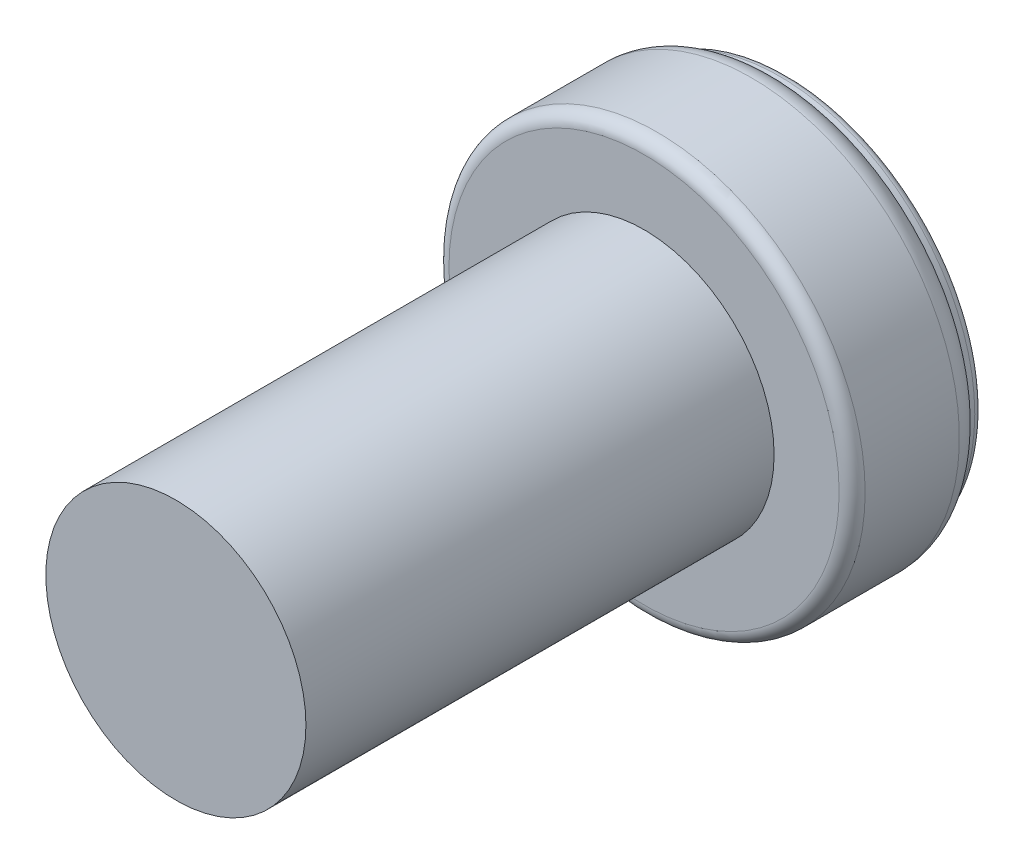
ISO-10303-21;
HEADER;
FILE_DESCRIPTION(('STEP AP214'),'2;1');
FILE_NAME('part.step','',(''),(''),'','','');
FILE_SCHEMA(('AUTOMOTIVE_DESIGN { 1 0 10303 214 1 1 1 1 }'));
ENDSEC;
DATA;
#1=APPLICATION_CONTEXT('core data for automotive mechanical design processes');
#2=APPLICATION_PROTOCOL_DEFINITION('international standard','automotive_design',2000,#1);
#3=PRODUCT_CONTEXT('',#1,'mechanical');
#4=PRODUCT('Part','Part','',(#3));
#5=PRODUCT_RELATED_PRODUCT_CATEGORY('part','',(#4));
#6=PRODUCT_DEFINITION_FORMATION('','',#4);
#7=PRODUCT_DEFINITION_CONTEXT('part definition',#1,'design');
#8=PRODUCT_DEFINITION('design','',#6,#7);
#9=PRODUCT_DEFINITION_SHAPE('','',#8);
#10=(LENGTH_UNIT() NAMED_UNIT(*) SI_UNIT(.MILLI.,.METRE.));
#11=(NAMED_UNIT(*) PLANE_ANGLE_UNIT() SI_UNIT($,.RADIAN.));
#12=(NAMED_UNIT(*) SI_UNIT($,.STERADIAN.) SOLID_ANGLE_UNIT());
#13=UNCERTAINTY_MEASURE_WITH_UNIT(LENGTH_MEASURE(1.E-05),#10,'distance_accuracy_value','');
#14=(GEOMETRIC_REPRESENTATION_CONTEXT(3) GLOBAL_UNCERTAINTY_ASSIGNED_CONTEXT((#13)) GLOBAL_UNIT_ASSIGNED_CONTEXT((#10,
#11,#12)) REPRESENTATION_CONTEXT('',''));
#15=CARTESIAN_POINT('',(0.,0.,0.));
#16=DIRECTION('',(0.,0.,1.));
#17=DIRECTION('',(1.,0.,0.));
#18=AXIS2_PLACEMENT_3D('',#15,#16,#17);
#19=CARTESIAN_POINT('',(0.0801792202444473,-0.24053766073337,4.98972152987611));
#20=DIRECTION('',(0.,0.,1.));
#21=DIRECTION('',(1.,0.,0.));
#22=AXIS2_PLACEMENT_3D('',#19,#20,#21);
#23=PLANE('',#22);
#24=CARTESIAN_POINT('',(0.0801792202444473,-0.24053766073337,4.98972152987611));
#25=DIRECTION('',(0.,0.,1.));
#26=DIRECTION('',(1.,0.,0.));
#27=AXIS2_PLACEMENT_3D('',#24,#25,#26);
#28=CIRCLE('',#27,7.5);
#29=CARTESIAN_POINT('',(7.58017922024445,-0.24053766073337,4.98972152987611));
#30=VERTEX_POINT('',#29);
#31=EDGE_CURVE('E40',#30,#30,#28,.T.);
#32=ORIENTED_EDGE('',*,*,#31,.T.);
#33=EDGE_LOOP('',(#32));
#34=FACE_BOUND('',#33,.T.);
#35=CARTESIAN_POINT('',(0.0801792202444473,-0.24053766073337,4.98972152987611));
#36=DIRECTION('',(0.,0.,1.));
#37=DIRECTION('',(1.,0.,0.));
#38=AXIS2_PLACEMENT_3D('',#35,#36,#37);
#39=CIRCLE('',#38,5.);
#40=CARTESIAN_POINT('',(5.08017922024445,-0.24053766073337,4.98972152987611));
#41=VERTEX_POINT('',#40);
#42=EDGE_CURVE('E102',#41,#41,#39,.T.);
#43=ORIENTED_EDGE('',*,*,#42,.F.);
#44=EDGE_LOOP('',(#43));
#45=FACE_BOUND('',#44,.T.);
#46=ADVANCED_FACE('F33',(#34,#45),#23,.T.);
#47=CARTESIAN_POINT('',(0.0801792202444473,-0.135203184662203,0.235788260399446));
#48=DIRECTION('',(0.,0.,-1.));
#49=DIRECTION('',(-1.,0.,0.));
#50=AXIS2_PLACEMENT_3D('',#47,#48,#49);
#51=PLANE('',#50);
#52=CARTESIAN_POINT('',(0.0801792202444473,-0.135203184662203,0.235788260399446));
#53=DIRECTION('',(0.,0.,-1.));
#54=DIRECTION('',(-1.,0.,0.));
#55=AXIS2_PLACEMENT_3D('',#52,#53,#54);
#56=CIRCLE('',#55,4.5);
#57=CARTESIAN_POINT('',(-4.41982077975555,-0.135203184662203,0.235788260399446));
#58=VERTEX_POINT('',#57);
#59=EDGE_CURVE('E92',#58,#58,#56,.T.);
#60=ORIENTED_EDGE('',*,*,#59,.T.);
#61=EDGE_LOOP('',(#60));
#62=FACE_BOUND('',#61,.T.);
#63=CARTESIAN_POINT('',(0.0801792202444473,-0.24053766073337,0.235788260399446));
#64=DIRECTION('',(0.,0.,-1.));
#65=DIRECTION('',(-1.,0.,0.));
#66=AXIS2_PLACEMENT_3D('',#63,#64,#65);
#67=CIRCLE('',#66,3.5);
#68=CARTESIAN_POINT('',(-3.41982077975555,-0.24053766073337,0.235788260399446));
#69=VERTEX_POINT('',#68);
#70=EDGE_CURVE('E95',#69,#69,#67,.T.);
#71=ORIENTED_EDGE('',*,*,#70,.F.);
#72=EDGE_LOOP('',(#71));
#73=FACE_BOUND('',#72,.T.);
#74=ADVANCED_FACE('F118',(#62,#73),#51,.T.);
#75=CARTESIAN_POINT('',(0.0801792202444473,-0.24053766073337,0.474548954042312));
#76=DIRECTION('',(0.,0.,-1.));
#77=DIRECTION('',(-1.,0.,0.));
#78=AXIS2_PLACEMENT_3D('',#75,#76,#77);
#79=PLANE('',#78);
#80=CARTESIAN_POINT('',(0.0801792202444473,-0.24053766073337,0.474548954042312));
#81=DIRECTION('',(0.,0.,-1.));
#82=DIRECTION('',(-1.,0.,0.));
#83=AXIS2_PLACEMENT_3D('',#80,#81,#82);
#84=CIRCLE('',#83,6.5);
#85=CARTESIAN_POINT('',(-6.41982077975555,-0.24053766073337,0.474548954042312));
#86=VERTEX_POINT('',#85);
#87=EDGE_CURVE('E86',#86,#86,#84,.T.);
#88=ORIENTED_EDGE('',*,*,#87,.T.);
#89=EDGE_LOOP('',(#88));
#90=FACE_BOUND('',#89,.T.);
#91=CARTESIAN_POINT('',(0.0801792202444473,-0.24053766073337,0.474548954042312));
#92=DIRECTION('',(0.,0.,-1.));
#93=DIRECTION('',(-1.,0.,0.));
#94=AXIS2_PLACEMENT_3D('',#91,#92,#93);
#95=CIRCLE('',#94,5.5);
#96=CARTESIAN_POINT('',(-5.41982077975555,-0.24053766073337,0.474548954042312));
#97=VERTEX_POINT('',#96);
#98=EDGE_CURVE('E89',#97,#97,#95,.T.);
#99=ORIENTED_EDGE('',*,*,#98,.F.);
#100=EDGE_LOOP('',(#99));
#101=FACE_BOUND('',#100,.T.);
#102=ADVANCED_FACE('F123',(#90,#101),#79,.T.);
#103=CARTESIAN_POINT('',(0.0801792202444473,-0.24053766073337,4.98972152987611));
#104=DIRECTION('',(0.,0.,-1.));
#105=DIRECTION('',(-1.,0.,0.));
#106=AXIS2_PLACEMENT_3D('',#103,#104,#105);
#107=CYLINDRICAL_SURFACE('',#106,8.);
#108=CARTESIAN_POINT('',(0.0801792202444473,-0.24053766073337,4.48972152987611));
#109=DIRECTION('',(0.,0.,1.));
#110=DIRECTION('',(1.,0.,0.));
#111=AXIS2_PLACEMENT_3D('',#108,#109,#110);
#112=CIRCLE('',#111,8.);
#113=CARTESIAN_POINT('',(8.08017922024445,-0.24053766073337,4.48972152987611));
#114=VERTEX_POINT('',#113);
#115=EDGE_CURVE('E10',#114,#114,#112,.F.);
#116=ORIENTED_EDGE('',*,*,#115,.T.);
#117=EDGE_LOOP('',(#116));
#118=FACE_BOUND('',#117,.T.);
#119=CARTESIAN_POINT('',(0.0801792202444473,-0.24053766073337,0.866025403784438));
#120=DIRECTION('',(0.,0.,-1.));
#121=DIRECTION('',(-1.,0.,0.));
#122=AXIS2_PLACEMENT_3D('',#119,#120,#121);
#123=CIRCLE('',#122,8.);
#124=CARTESIAN_POINT('',(-7.91982077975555,-0.24053766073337,0.866025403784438));
#125=VERTEX_POINT('',#124);
#126=EDGE_CURVE('E44',#125,#125,#123,.F.);
#127=ORIENTED_EDGE('',*,*,#126,.T.);
#128=EDGE_LOOP('',(#127));
#129=FACE_BOUND('',#128,.T.);
#130=ADVANCED_FACE('F130',(#118,#129),#107,.T.);
#131=CARTESIAN_POINT('',(0.0801792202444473,-0.24053766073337,-0.525451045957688));
#132=DIRECTION('',(0.,0.,1.));
#133=DIRECTION('',(1.,0.,0.));
#134=AXIS2_PLACEMENT_3D('',#131,#132,#133);
#135=CYLINDRICAL_SURFACE('',#134,7.5);
#136=CARTESIAN_POINT('',(0.0801792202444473,-0.24053766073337,-0.225451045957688));
#137=DIRECTION('',(0.,0.,-1.));
#138=DIRECTION('',(-1.,0.,0.));
#139=AXIS2_PLACEMENT_3D('',#136,#137,#138);
#140=CIRCLE('',#139,7.5);
#141=CARTESIAN_POINT('',(-7.41982077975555,-0.24053766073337,-0.225451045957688));
#142=VERTEX_POINT('',#141);
#143=EDGE_CURVE('E77',#142,#142,#140,.F.);
#144=ORIENTED_EDGE('',*,*,#143,.T.);
#145=EDGE_LOOP('',(#144));
#146=FACE_BOUND('',#145,.T.);
#147=CARTESIAN_POINT('',(0.0801792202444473,-0.24053766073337,0.));
#148=DIRECTION('',(0.,0.,1.));
#149=DIRECTION('',(1.,0.,0.));
#150=AXIS2_PLACEMENT_3D('',#147,#148,#149);
#151=CIRCLE('',#150,7.5);
#152=CARTESIAN_POINT('',(7.58017922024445,-0.24053766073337,0.));
#153=VERTEX_POINT('',#152);
#154=EDGE_CURVE('E83',#153,#153,#151,.F.);
#155=ORIENTED_EDGE('',*,*,#154,.T.);
#156=EDGE_LOOP('',(#155));
#157=FACE_BOUND('',#156,.T.);
#158=ADVANCED_FACE('F128',(#146,#157),#135,.T.);
#159=CARTESIAN_POINT('',(0.0801792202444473,-0.24053766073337,-0.525451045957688));
#160=DIRECTION('',(0.,0.,-1.));
#161=DIRECTION('',(-1.,0.,0.));
#162=AXIS2_PLACEMENT_3D('',#159,#160,#161);
#163=PLANE('',#162);
#164=CARTESIAN_POINT('',(0.0801792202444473,-0.24053766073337,-0.525451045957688));
#165=DIRECTION('',(0.,0.,-1.));
#166=DIRECTION('',(-1.,0.,0.));
#167=AXIS2_PLACEMENT_3D('',#164,#165,#166);
#168=CIRCLE('',#167,6.8);
#169=CARTESIAN_POINT('',(-6.71982077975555,-0.24053766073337,-0.525451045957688));
#170=VERTEX_POINT('',#169);
#171=EDGE_CURVE('E71',#170,#170,#168,.F.);
#172=ORIENTED_EDGE('',*,*,#171,.T.);
#173=EDGE_LOOP('',(#172));
#174=FACE_BOUND('',#173,.T.);
#175=CARTESIAN_POINT('',(0.0801792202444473,-0.24053766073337,-0.525451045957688));
#176=DIRECTION('',(0.,0.,-1.));
#177=DIRECTION('',(-1.,0.,0.));
#178=AXIS2_PLACEMENT_3D('',#175,#176,#177);
#179=CIRCLE('',#178,7.2);
#180=CARTESIAN_POINT('',(-7.11982077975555,-0.24053766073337,-0.525451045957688));
#181=VERTEX_POINT('',#180);
#182=EDGE_CURVE('E80',#181,#181,#179,.T.);
#183=ORIENTED_EDGE('',*,*,#182,.T.);
#184=EDGE_LOOP('',(#183));
#185=FACE_BOUND('',#184,.T.);
#186=ADVANCED_FACE('F175',(#174,#185),#163,.T.);
#187=CARTESIAN_POINT('',(0.0801792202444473,-0.24053766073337,0.474548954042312));
#188=DIRECTION('',(0.,0.,-1.));
#189=DIRECTION('',(-1.,0.,0.));
#190=AXIS2_PLACEMENT_3D('',#187,#188,#189);
#191=CYLINDRICAL_SURFACE('',#190,6.5);
#192=CARTESIAN_POINT('',(0.0801792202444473,-0.24053766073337,-0.225451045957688));
#193=DIRECTION('',(0.,0.,-1.));
#194=DIRECTION('',(-1.,0.,0.));
#195=AXIS2_PLACEMENT_3D('',#192,#193,#194);
#196=CIRCLE('',#195,6.5);
#197=CARTESIAN_POINT('',(-6.41982077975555,-0.24053766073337,-0.225451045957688));
#198=VERTEX_POINT('',#197);
#199=EDGE_CURVE('E74',#198,#198,#196,.T.);
#200=ORIENTED_EDGE('',*,*,#199,.T.);
#201=EDGE_LOOP('',(#200));
#202=FACE_BOUND('',#201,.T.);
#203=ORIENTED_EDGE('',*,*,#87,.F.);
#204=EDGE_LOOP('',(#203));
#205=FACE_BOUND('',#204,.T.);
#206=ADVANCED_FACE('F137',(#202,#205),#191,.F.);
#207=CARTESIAN_POINT('',(0.0801792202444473,-0.24053766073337,-0.225451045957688));
#208=DIRECTION('',(0.,0.,-1.));
#209=DIRECTION('',(-1.,0.,0.));
#210=AXIS2_PLACEMENT_3D('',#207,#208,#209);
#211=TOROIDAL_SURFACE('',#210,7.2,0.3);
#212=ORIENTED_EDGE('',*,*,#143,.F.);
#213=EDGE_LOOP('',(#212));
#214=FACE_BOUND('',#213,.T.);
#215=ORIENTED_EDGE('',*,*,#182,.F.);
#216=EDGE_LOOP('',(#215));
#217=FACE_BOUND('',#216,.T.);
#218=ADVANCED_FACE('F133',(#214,#217),#211,.T.);
#219=CARTESIAN_POINT('',(0.0801792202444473,-0.24053766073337,-0.225451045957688));
#220=DIRECTION('',(0.,0.,-1.));
#221=DIRECTION('',(-1.,0.,0.));
#222=AXIS2_PLACEMENT_3D('',#219,#220,#221);
#223=TOROIDAL_SURFACE('',#222,6.8,0.3);
#224=ORIENTED_EDGE('',*,*,#171,.F.);
#225=EDGE_LOOP('',(#224));
#226=FACE_BOUND('',#225,.T.);
#227=ORIENTED_EDGE('',*,*,#199,.F.);
#228=EDGE_LOOP('',(#227));
#229=FACE_BOUND('',#228,.T.);
#230=ADVANCED_FACE('F136',(#226,#229),#223,.T.);
#231=CARTESIAN_POINT('',(0.0801792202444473,-0.24053766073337,-0.525451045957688));
#232=DIRECTION('',(0.,0.,1.));
#233=DIRECTION('',(1.,0.,0.));
#234=AXIS2_PLACEMENT_3D('',#231,#232,#233);
#235=CYLINDRICAL_SURFACE('',#234,5.5);
#236=CARTESIAN_POINT('',(0.0801792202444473,-0.24053766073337,-0.225451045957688));
#237=DIRECTION('',(0.,0.,-1.));
#238=DIRECTION('',(-1.,0.,0.));
#239=AXIS2_PLACEMENT_3D('',#236,#237,#238);
#240=CIRCLE('',#239,5.5);
#241=CARTESIAN_POINT('',(-5.41982077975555,-0.24053766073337,-0.225451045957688));
#242=VERTEX_POINT('',#241);
#243=EDGE_CURVE('E59',#242,#242,#240,.F.);
#244=ORIENTED_EDGE('',*,*,#243,.T.);
#245=EDGE_LOOP('',(#244));
#246=FACE_BOUND('',#245,.T.);
#247=ORIENTED_EDGE('',*,*,#98,.T.);
#248=EDGE_LOOP('',(#247));
#249=FACE_BOUND('',#248,.T.);
#250=ADVANCED_FACE('F141',(#246,#249),#235,.T.);
#251=CARTESIAN_POINT('',(0.0801792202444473,-0.24053766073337,-0.525451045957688));
#252=DIRECTION('',(0.,0.,-1.));
#253=DIRECTION('',(-1.,0.,0.));
#254=AXIS2_PLACEMENT_3D('',#251,#252,#253);
#255=PLANE('',#254);
#256=CARTESIAN_POINT('',(0.0801792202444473,-0.135203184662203,-0.525451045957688));
#257=DIRECTION('',(0.,0.,-1.));
#258=DIRECTION('',(-1.,0.,0.));
#259=AXIS2_PLACEMENT_3D('',#256,#257,#258);
#260=CIRCLE('',#259,4.8);
#261=CARTESIAN_POINT('',(-4.71982077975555,-0.135203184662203,-0.525451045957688));
#262=VERTEX_POINT('',#261);
#263=EDGE_CURVE('E62',#262,#262,#260,.F.);
#264=ORIENTED_EDGE('',*,*,#263,.T.);
#265=EDGE_LOOP('',(#264));
#266=FACE_BOUND('',#265,.T.);
#267=CARTESIAN_POINT('',(0.0801792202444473,-0.24053766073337,-0.525451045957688));
#268=DIRECTION('',(0.,0.,-1.));
#269=DIRECTION('',(-1.,0.,0.));
#270=AXIS2_PLACEMENT_3D('',#267,#268,#269);
#271=CIRCLE('',#270,5.2);
#272=CARTESIAN_POINT('',(-5.11982077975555,-0.24053766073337,-0.525451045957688));
#273=VERTEX_POINT('',#272);
#274=EDGE_CURVE('E65',#273,#273,#271,.T.);
#275=ORIENTED_EDGE('',*,*,#274,.T.);
#276=EDGE_LOOP('',(#275));
#277=FACE_BOUND('',#276,.T.);
#278=ADVANCED_FACE('F196',(#266,#277),#255,.T.);
#279=CARTESIAN_POINT('',(0.0801792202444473,-0.135203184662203,0.235788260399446));
#280=DIRECTION('',(0.,0.,-1.));
#281=DIRECTION('',(-1.,0.,0.));
#282=AXIS2_PLACEMENT_3D('',#279,#280,#281);
#283=CYLINDRICAL_SURFACE('',#282,4.5);
#284=CARTESIAN_POINT('',(0.0801792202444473,-0.135203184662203,-0.225451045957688));
#285=DIRECTION('',(0.,0.,-1.));
#286=DIRECTION('',(-1.,0.,0.));
#287=AXIS2_PLACEMENT_3D('',#284,#285,#286);
#288=CIRCLE('',#287,4.5);
#289=CARTESIAN_POINT('',(-4.41982077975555,-0.135203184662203,-0.225451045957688));
#290=VERTEX_POINT('',#289);
#291=EDGE_CURVE('E68',#290,#290,#288,.T.);
#292=CARTESIAN_POINT('',(-4.41982077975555,-0.135203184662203,-0.225451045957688));
#293=CARTESIAN_POINT('',(-4.41982077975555,-0.135203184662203,-0.220646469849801));
#294=CARTESIAN_POINT('',(-4.41982077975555,-0.135203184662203,-0.215841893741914));
#295=CARTESIAN_POINT('',(-4.41982077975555,-0.135203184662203,-0.206232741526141));
#296=CARTESIAN_POINT('',(-4.41982077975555,-0.135203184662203,-0.201428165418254));
#297=CARTESIAN_POINT('',(-4.41982077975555,-0.135203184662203,-0.19181901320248));
#298=CARTESIAN_POINT('',(-4.41982077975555,-0.135203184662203,-0.187014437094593));
#299=CARTESIAN_POINT('',(-4.41982077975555,-0.135203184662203,-0.17740528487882));
#300=CARTESIAN_POINT('',(-4.41982077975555,-0.135203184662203,-0.172600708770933));
#301=CARTESIAN_POINT('',(-4.41982077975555,-0.135203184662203,-0.162991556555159));
#302=CARTESIAN_POINT('',(-4.41982077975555,-0.135203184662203,-0.158186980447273));
#303=CARTESIAN_POINT('',(-4.41982077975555,-0.135203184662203,-0.148577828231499));
#304=CARTESIAN_POINT('',(-4.41982077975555,-0.135203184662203,-0.143773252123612));
#305=CARTESIAN_POINT('',(-4.41982077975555,-0.135203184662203,-0.134164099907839));
#306=CARTESIAN_POINT('',(-4.41982077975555,-0.135203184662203,-0.129359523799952));
#307=CARTESIAN_POINT('',(-4.41982077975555,-0.135203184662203,-0.119750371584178));
#308=CARTESIAN_POINT('',(-4.41982077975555,-0.135203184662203,-0.114945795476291));
#309=CARTESIAN_POINT('',(-4.41982077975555,-0.135203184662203,-0.105336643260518));
#310=CARTESIAN_POINT('',(-4.41982077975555,-0.135203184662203,-0.100532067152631));
#311=CARTESIAN_POINT('',(-4.41982077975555,-0.135203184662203,-0.0909229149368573));
#312=CARTESIAN_POINT('',(-4.41982077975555,-0.135203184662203,-0.0861183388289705));
#313=CARTESIAN_POINT('',(-4.41982077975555,-0.135203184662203,-0.0765091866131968));
#314=CARTESIAN_POINT('',(-4.41982077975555,-0.135203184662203,-0.07170461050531));
#315=CARTESIAN_POINT('',(-4.41982077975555,-0.135203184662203,-0.0620954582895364));
#316=CARTESIAN_POINT('',(-4.41982077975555,-0.135203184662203,-0.0572908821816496));
#317=CARTESIAN_POINT('',(-4.41982077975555,-0.135203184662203,-0.047681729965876));
#318=CARTESIAN_POINT('',(-4.41982077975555,-0.135203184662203,-0.0428771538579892));
#319=CARTESIAN_POINT('',(-4.41982077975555,-0.135203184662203,-0.0332680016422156));
#320=CARTESIAN_POINT('',(-4.41982077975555,-0.135203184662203,-0.0284634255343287));
#321=CARTESIAN_POINT('',(-4.41982077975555,-0.135203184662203,-0.0188542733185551));
#322=CARTESIAN_POINT('',(-4.41982077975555,-0.135203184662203,-0.0140496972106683));
#323=CARTESIAN_POINT('',(-4.41982077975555,-0.135203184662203,-0.00444054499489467));
#324=CARTESIAN_POINT('',(-4.41982077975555,-0.135203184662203,0.000364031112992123));
#325=CARTESIAN_POINT('',(-4.41982077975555,-0.135203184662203,0.00997318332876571));
#326=CARTESIAN_POINT('',(-4.41982077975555,-0.135203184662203,0.0147777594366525));
#327=CARTESIAN_POINT('',(-4.41982077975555,-0.135203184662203,0.0243869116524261));
#328=CARTESIAN_POINT('',(-4.41982077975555,-0.135203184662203,0.029191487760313));
#329=CARTESIAN_POINT('',(-4.41982077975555,-0.135203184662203,0.0388006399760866));
#330=CARTESIAN_POINT('',(-4.41982077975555,-0.135203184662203,0.0436052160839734));
#331=CARTESIAN_POINT('',(-4.41982077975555,-0.135203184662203,0.053214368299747));
#332=CARTESIAN_POINT('',(-4.41982077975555,-0.135203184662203,0.0580189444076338));
#333=CARTESIAN_POINT('',(-4.41982077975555,-0.135203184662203,0.0676280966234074));
#334=CARTESIAN_POINT('',(-4.41982077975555,-0.135203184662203,0.0724326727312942));
#335=CARTESIAN_POINT('',(-4.41982077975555,-0.135203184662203,0.0820418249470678));
#336=CARTESIAN_POINT('',(-4.41982077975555,-0.135203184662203,0.0868464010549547));
#337=CARTESIAN_POINT('',(-4.41982077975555,-0.135203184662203,0.0964555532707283));
#338=CARTESIAN_POINT('',(-4.41982077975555,-0.135203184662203,0.101260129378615));
#339=CARTESIAN_POINT('',(-4.41982077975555,-0.135203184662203,0.110869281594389));
#340=CARTESIAN_POINT('',(-4.41982077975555,-0.135203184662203,0.115673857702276));
#341=CARTESIAN_POINT('',(-4.41982077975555,-0.135203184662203,0.125283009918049));
#342=CARTESIAN_POINT('',(-4.41982077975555,-0.135203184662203,0.130087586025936));
#343=CARTESIAN_POINT('',(-4.41982077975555,-0.135203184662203,0.13969673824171));
#344=CARTESIAN_POINT('',(-4.41982077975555,-0.135203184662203,0.144501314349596));
#345=CARTESIAN_POINT('',(-4.41982077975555,-0.135203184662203,0.15411046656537));
#346=CARTESIAN_POINT('',(-4.41982077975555,-0.135203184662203,0.158915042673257));
#347=CARTESIAN_POINT('',(-4.41982077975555,-0.135203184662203,0.16852419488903));
#348=CARTESIAN_POINT('',(-4.41982077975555,-0.135203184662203,0.173328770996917));
#349=CARTESIAN_POINT('',(-4.41982077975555,-0.135203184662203,0.182937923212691));
#350=CARTESIAN_POINT('',(-4.41982077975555,-0.135203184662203,0.187742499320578));
#351=CARTESIAN_POINT('',(-4.41982077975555,-0.135203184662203,0.197351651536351));
#352=CARTESIAN_POINT('',(-4.41982077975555,-0.135203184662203,0.202156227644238));
#353=CARTESIAN_POINT('',(-4.41982077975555,-0.135203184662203,0.211765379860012));
#354=CARTESIAN_POINT('',(-4.41982077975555,-0.135203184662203,0.216569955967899));
#355=CARTESIAN_POINT('',(-4.41982077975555,-0.135203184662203,0.226179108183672));
#356=CARTESIAN_POINT('',(-4.41982077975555,-0.135203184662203,0.230983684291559));
#357=CARTESIAN_POINT('',(-4.41982077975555,-0.135203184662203,0.235788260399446));
#358=B_SPLINE_CURVE_WITH_KNOTS('',3,(#292,#293,#294,#295,#296,#297,#298,#299,#300,#301,#302,
#303,#304,#305,#306,#307,#308,#309,#310,#311,#312,#313,#314,#315,#316,#317,#318,#319,#320,#321,
#322,#323,#324,#325,#326,#327,#328,#329,#330,#331,#332,#333,#334,#335,#336,#337,#338,#339,#340,
#341,#342,#343,#344,#345,#346,#347,#348,#349,#350,#351,#352,#353,#354,#355,#356,#357),
.UNSPECIFIED.,.F.,.F.,(4,2,2,2,2,2,2,2,2,2,2,2,2,2,2,2,2,2,2,2,2,2,2,2,2,2,2,2,2,2,2,2,4),(0.,
0.0144137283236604,0.0288274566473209,0.0432411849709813,0.0576549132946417,0.0720686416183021,
0.0864823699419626,0.100896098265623,0.115309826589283,0.129723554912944,0.144137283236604,
0.158551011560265,0.172964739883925,0.187378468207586,0.201792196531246,0.216205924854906,
0.230619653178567,0.245033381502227,0.259447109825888,0.273860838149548,0.288274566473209,
0.302688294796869,0.317102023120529,0.33151575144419,0.34592947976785,0.360343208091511,
0.374756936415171,0.389170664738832,0.403584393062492,0.417998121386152,0.432411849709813,
0.446825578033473,0.461239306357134),.UNSPECIFIED.);
#359=EDGE_CURVE('BSEAM147',#290,#58,#358,.T.);
#360=ORIENTED_EDGE('',*,*,#291,.T.);
#361=ORIENTED_EDGE('',*,*,#59,.F.);
#362=ORIENTED_EDGE('',*,*,#359,.T.);
#363=ORIENTED_EDGE('',*,*,#359,.F.);
#364=EDGE_LOOP('',(#360,#362,#361,#363));
#365=FACE_BOUND('',#364,.T.);
#366=ADVANCED_FACE('F147',(#365),#283,.F.);
#367=CARTESIAN_POINT('',(0.0801792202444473,-0.135203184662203,-0.225451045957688));
#368=DIRECTION('',(0.,0.,-1.));
#369=DIRECTION('',(-1.,0.,0.));
#370=AXIS2_PLACEMENT_3D('',#367,#368,#369);
#371=TOROIDAL_SURFACE('',#370,4.8,0.3);
#372=ORIENTED_EDGE('',*,*,#263,.F.);
#373=EDGE_LOOP('',(#372));
#374=FACE_BOUND('',#373,.T.);
#375=ORIENTED_EDGE('',*,*,#291,.F.);
#376=EDGE_LOOP('',(#375));
#377=FACE_BOUND('',#376,.T.);
#378=ADVANCED_FACE('F143',(#374,#377),#371,.T.);
#379=CARTESIAN_POINT('',(0.0801792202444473,-0.24053766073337,-0.225451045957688));
#380=DIRECTION('',(0.,0.,-1.));
#381=DIRECTION('',(-1.,0.,0.));
#382=AXIS2_PLACEMENT_3D('',#379,#380,#381);
#383=TOROIDAL_SURFACE('',#382,5.2,0.3);
#384=ORIENTED_EDGE('',*,*,#243,.F.);
#385=EDGE_LOOP('',(#384));
#386=FACE_BOUND('',#385,.T.);
#387=ORIENTED_EDGE('',*,*,#274,.F.);
#388=EDGE_LOOP('',(#387));
#389=FACE_BOUND('',#388,.T.);
#390=ADVANCED_FACE('F146',(#386,#389),#383,.T.);
#391=CARTESIAN_POINT('',(0.0801792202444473,-0.24053766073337,-0.764211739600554));
#392=DIRECTION('',(0.,0.,1.));
#393=DIRECTION('',(1.,0.,0.));
#394=AXIS2_PLACEMENT_3D('',#391,#392,#393);
#395=CYLINDRICAL_SURFACE('',#394,3.5);
#396=CARTESIAN_POINT('',(0.0801792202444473,-0.24053766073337,-0.464211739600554));
#397=DIRECTION('',(0.,0.,-1.));
#398=DIRECTION('',(-1.,0.,0.));
#399=AXIS2_PLACEMENT_3D('',#396,#397,#398);
#400=CIRCLE('',#399,3.5);
#401=CARTESIAN_POINT('',(-3.41982077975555,-0.24053766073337,-0.464211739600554));
#402=VERTEX_POINT('',#401);
#403=EDGE_CURVE('E48',#402,#402,#400,.F.);
#404=ORIENTED_EDGE('',*,*,#403,.T.);
#405=EDGE_LOOP('',(#404));
#406=FACE_BOUND('',#405,.T.);
#407=ORIENTED_EDGE('',*,*,#70,.T.);
#408=EDGE_LOOP('',(#407));
#409=FACE_BOUND('',#408,.T.);
#410=ADVANCED_FACE('F151',(#406,#409),#395,.T.);
#411=CARTESIAN_POINT('',(0.0801792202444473,-0.24053766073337,-0.764211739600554));
#412=DIRECTION('',(0.,0.,-1.));
#413=DIRECTION('',(-1.,0.,0.));
#414=AXIS2_PLACEMENT_3D('',#411,#412,#413);
#415=PLANE('',#414);
#416=CARTESIAN_POINT('',(0.0801792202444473,-0.24053766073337,-0.764211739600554));
#417=DIRECTION('',(0.,0.,-1.));
#418=DIRECTION('',(-1.,0.,0.));
#419=AXIS2_PLACEMENT_3D('',#416,#417,#418);
#420=CIRCLE('',#419,2.79986938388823);
#421=CARTESIAN_POINT('',(-2.71969016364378,-0.24053766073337,-0.764211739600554));
#422=VERTEX_POINT('',#421);
#423=EDGE_CURVE('E53',#422,#422,#420,.F.);
#424=ORIENTED_EDGE('',*,*,#423,.T.);
#425=EDGE_LOOP('',(#424));
#426=FACE_BOUND('',#425,.T.);
#427=CARTESIAN_POINT('',(0.0801792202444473,-0.24053766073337,-0.764211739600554));
#428=DIRECTION('',(0.,0.,-1.));
#429=DIRECTION('',(-1.,0.,0.));
#430=AXIS2_PLACEMENT_3D('',#427,#428,#429);
#431=CIRCLE('',#430,3.2);
#432=CARTESIAN_POINT('',(-3.11982077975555,-0.24053766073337,-0.764211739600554));
#433=VERTEX_POINT('',#432);
#434=EDGE_CURVE('E56',#433,#433,#431,.T.);
#435=ORIENTED_EDGE('',*,*,#434,.T.);
#436=EDGE_LOOP('',(#435));
#437=FACE_BOUND('',#436,.T.);
#438=ADVANCED_FACE('F206',(#426,#437),#415,.T.);
#439=CARTESIAN_POINT('',(0.0801792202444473,-0.24053766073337,-0.473063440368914));
#440=DIRECTION('',(0.,0.,-1.));
#441=DIRECTION('',(-1.,0.,0.));
#442=AXIS2_PLACEMENT_3D('',#439,#440,#441);
#443=PLANE('',#442);
#444=CARTESIAN_POINT('',(0.0801792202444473,-0.24053766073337,-0.473063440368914));
#445=DIRECTION('',(0.,0.,-1.));
#446=DIRECTION('',(-1.,0.,0.));
#447=AXIS2_PLACEMENT_3D('',#444,#445,#446);
#448=CIRCLE('',#447,2.5);
#449=CARTESIAN_POINT('',(-2.41982077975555,-0.24053766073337,-0.473063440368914));
#450=VERTEX_POINT('',#449);
#451=EDGE_CURVE('E98',#450,#450,#448,.T.);
#452=ORIENTED_EDGE('',*,*,#451,.T.);
#453=EDGE_LOOP('',(#452));
#454=FACE_BOUND('',#453,.T.);
#455=ADVANCED_FACE('F156',(#454),#443,.T.);
#456=CARTESIAN_POINT('',(0.0801792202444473,-0.24053766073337,-0.464211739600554));
#457=DIRECTION('',(0.,0.,-1.));
#458=DIRECTION('',(-1.,0.,0.));
#459=AXIS2_PLACEMENT_3D('',#456,#457,#458);
#460=TOROIDAL_SURFACE('',#459,2.79986938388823,0.3);
#461=ORIENTED_EDGE('',*,*,#423,.F.);
#462=EDGE_LOOP('',(#461));
#463=FACE_BOUND('',#462,.T.);
#464=ORIENTED_EDGE('',*,*,#451,.F.);
#465=EDGE_LOOP('',(#464));
#466=FACE_BOUND('',#465,.T.);
#467=ADVANCED_FACE('F153',(#463,#466),#460,.T.);
#468=CARTESIAN_POINT('',(0.0801792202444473,-0.24053766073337,-0.464211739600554));
#469=DIRECTION('',(0.,0.,-1.));
#470=DIRECTION('',(-1.,0.,0.));
#471=AXIS2_PLACEMENT_3D('',#468,#469,#470);
#472=TOROIDAL_SURFACE('',#471,3.2,0.3);
#473=ORIENTED_EDGE('',*,*,#403,.F.);
#474=EDGE_LOOP('',(#473));
#475=FACE_BOUND('',#474,.T.);
#476=ORIENTED_EDGE('',*,*,#434,.F.);
#477=EDGE_LOOP('',(#476));
#478=FACE_BOUND('',#477,.T.);
#479=ADVANCED_FACE('F113',(#475,#478),#472,.T.);
#480=CARTESIAN_POINT('',(0.0801792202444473,-0.24053766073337,22.9897215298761));
#481=DIRECTION('',(0.,0.,-1.));
#482=DIRECTION('',(-1.,0.,0.));
#483=AXIS2_PLACEMENT_3D('',#480,#481,#482);
#484=CYLINDRICAL_SURFACE('',#483,5.);
#485=CARTESIAN_POINT('',(0.0801792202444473,-0.24053766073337,22.9897215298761));
#486=DIRECTION('',(0.,0.,1.));
#487=DIRECTION('',(1.,0.,0.));
#488=AXIS2_PLACEMENT_3D('',#485,#486,#487);
#489=CIRCLE('',#488,5.);
#490=CARTESIAN_POINT('',(5.08017922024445,-0.24053766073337,22.9897215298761));
#491=VERTEX_POINT('',#490);
#492=EDGE_CURVE('E101',#491,#491,#489,.T.);
#493=ORIENTED_EDGE('',*,*,#492,.F.);
#494=EDGE_LOOP('',(#493));
#495=FACE_BOUND('',#494,.T.);
#496=ORIENTED_EDGE('',*,*,#42,.T.);
#497=EDGE_LOOP('',(#496));
#498=FACE_BOUND('',#497,.T.);
#499=ADVANCED_FACE('F110',(#495,#498),#484,.T.);
#500=CARTESIAN_POINT('',(0.0801792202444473,-0.24053766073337,22.9897215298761));
#501=DIRECTION('',(0.,0.,1.));
#502=DIRECTION('',(1.,0.,0.));
#503=AXIS2_PLACEMENT_3D('',#500,#501,#502);
#504=PLANE('',#503);
#505=ORIENTED_EDGE('',*,*,#492,.T.);
#506=EDGE_LOOP('',(#505));
#507=FACE_BOUND('',#506,.T.);
#508=ADVANCED_FACE('F108',(#507),#504,.T.);
#509=CARTESIAN_POINT('',(0.0801792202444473,-0.24053766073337,0.866025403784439));
#510=DIRECTION('',(0.,0.,-1.));
#511=DIRECTION('',(-1.,0.,0.));
#512=AXIS2_PLACEMENT_3D('',#509,#510,#511);
#513=TOROIDAL_SURFACE('',#512,7.,1.);
#514=ORIENTED_EDGE('',*,*,#154,.F.);
#515=EDGE_LOOP('',(#514));
#516=FACE_BOUND('',#515,.T.);
#517=ORIENTED_EDGE('',*,*,#126,.F.);
#518=EDGE_LOOP('',(#517));
#519=FACE_BOUND('',#518,.T.);
#520=ADVANCED_FACE('F160',(#516,#519),#513,.T.);
#521=CARTESIAN_POINT('',(0.0801792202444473,-0.24053766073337,4.48972152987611));
#522=DIRECTION('',(0.,0.,1.));
#523=DIRECTION('',(1.,0.,0.));
#524=AXIS2_PLACEMENT_3D('',#521,#522,#523);
#525=TOROIDAL_SURFACE('',#524,7.5,0.5);
#526=ORIENTED_EDGE('',*,*,#115,.F.);
#527=EDGE_LOOP('',(#526));
#528=FACE_BOUND('',#527,.T.);
#529=ORIENTED_EDGE('',*,*,#31,.F.);
#530=EDGE_LOOP('',(#529));
#531=FACE_BOUND('',#530,.T.);
#532=ADVANCED_FACE('F35',(#528,#531),#525,.T.);
#533=CLOSED_SHELL('',(#46,#74,#102,#130,#158,#186,#206,#218,#230,#250,#278,#366,#378,#390,#410,
#438,#455,#467,#479,#499,#508,#520,#532));
#534=MANIFOLD_SOLID_BREP('B2',#533);
#535=ADVANCED_BREP_SHAPE_REPRESENTATION('',(#18,#534),#14);
#536=SHAPE_DEFINITION_REPRESENTATION(#9,#535);
ENDSEC;
END-ISO-10303-21;
